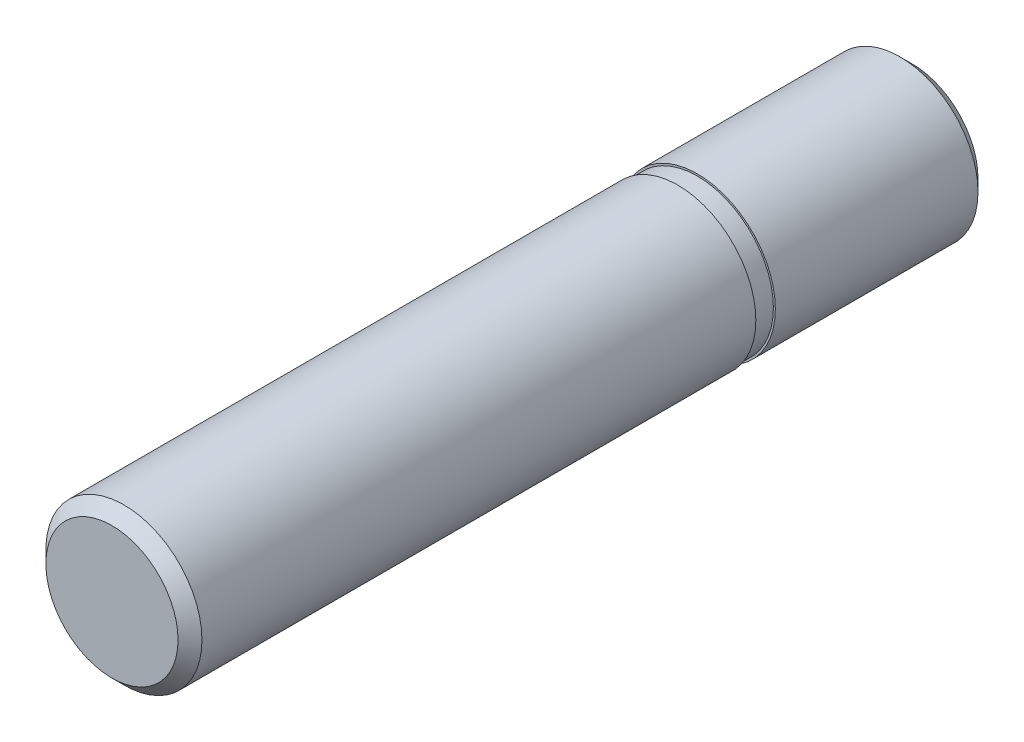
ISO-10303-21;
HEADER;
FILE_DESCRIPTION(('STEP AP214'),'2;1');
FILE_NAME('part.step','',(''),(''),'','','');
FILE_SCHEMA(('AUTOMOTIVE_DESIGN { 1 0 10303 214 1 1 1 1 }'));
ENDSEC;
DATA;
#1=APPLICATION_CONTEXT('core data for automotive mechanical design processes');
#2=APPLICATION_PROTOCOL_DEFINITION('international standard','automotive_design',2000,#1);
#3=PRODUCT_CONTEXT('',#1,'mechanical');
#4=PRODUCT('Part','Part','',(#3));
#5=PRODUCT_RELATED_PRODUCT_CATEGORY('part','',(#4));
#6=PRODUCT_DEFINITION_FORMATION('','',#4);
#7=PRODUCT_DEFINITION_CONTEXT('part definition',#1,'design');
#8=PRODUCT_DEFINITION('design','',#6,#7);
#9=PRODUCT_DEFINITION_SHAPE('','',#8);
#10=(LENGTH_UNIT() NAMED_UNIT(*) SI_UNIT(.MILLI.,.METRE.));
#11=(NAMED_UNIT(*) PLANE_ANGLE_UNIT() SI_UNIT($,.RADIAN.));
#12=(NAMED_UNIT(*) SI_UNIT($,.STERADIAN.) SOLID_ANGLE_UNIT());
#13=UNCERTAINTY_MEASURE_WITH_UNIT(LENGTH_MEASURE(1.E-05),#10,'distance_accuracy_value','');
#14=(GEOMETRIC_REPRESENTATION_CONTEXT(3) GLOBAL_UNCERTAINTY_ASSIGNED_CONTEXT((#13)) GLOBAL_UNIT_ASSIGNED_CONTEXT((#10,
#11,#12)) REPRESENTATION_CONTEXT('',''));
#15=CARTESIAN_POINT('',(0.,0.,0.));
#16=DIRECTION('',(0.,0.,1.));
#17=DIRECTION('',(1.,0.,0.));
#18=AXIS2_PLACEMENT_3D('',#15,#16,#17);
#19=CARTESIAN_POINT('',(0.,3.3865,-22.));
#20=DIRECTION('',(0.,0.,-1.));
#21=DIRECTION('',(-1.,0.,0.));
#22=AXIS2_PLACEMENT_3D('',#19,#20,#21);
#23=PLANE('',#22);
#24=CARTESIAN_POINT('',(0.,0.,-22.));
#25=DIRECTION('',(0.,0.,1.));
#26=DIRECTION('',(1.,0.,0.));
#27=AXIS2_PLACEMENT_3D('',#24,#25,#26);
#28=CIRCLE('',#27,6.773);
#29=CARTESIAN_POINT('',(6.773,0.,-22.));
#30=VERTEX_POINT('',#29);
#31=EDGE_CURVE('E19',#30,#30,#28,.T.);
#32=ORIENTED_EDGE('',*,*,#31,.F.);
#33=EDGE_LOOP('',(#32));
#34=FACE_BOUND('',#33,.T.);
#35=ADVANCED_FACE('F12',(#34),#23,.T.);
#36=CARTESIAN_POINT('',(0.,0.,-20.773));
#37=DIRECTION('',(0.,0.,1.));
#38=DIRECTION('',(1.,0.,0.));
#39=AXIS2_PLACEMENT_3D('',#36,#37,#38);
#40=CONICAL_SURFACE('',#39,8.,0.785398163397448);
#41=CARTESIAN_POINT('',(0.,0.,-20.773));
#42=DIRECTION('',(0.,0.,1.));
#43=DIRECTION('',(1.,0.,0.));
#44=AXIS2_PLACEMENT_3D('',#41,#42,#43);
#45=CIRCLE('',#44,8.);
#46=CARTESIAN_POINT('',(8.,0.,-20.773));
#47=VERTEX_POINT('',#46);
#48=EDGE_CURVE('E23',#47,#47,#45,.T.);
#49=ORIENTED_EDGE('',*,*,#48,.F.);
#50=EDGE_LOOP('',(#49));
#51=FACE_BOUND('',#50,.T.);
#52=ORIENTED_EDGE('',*,*,#31,.T.);
#53=EDGE_LOOP('',(#52));
#54=FACE_BOUND('',#53,.T.);
#55=ADVANCED_FACE('F66',(#51,#54),#40,.T.);
#56=CARTESIAN_POINT('',(0.,0.,5.));
#57=DIRECTION('',(0.,0.,1.));
#58=DIRECTION('',(1.,0.,0.));
#59=AXIS2_PLACEMENT_3D('',#56,#57,#58);
#60=CYLINDRICAL_SURFACE('',#59,8.);
#61=CARTESIAN_POINT('',(0.,0.,0.));
#62=DIRECTION('',(0.,0.,1.));
#63=DIRECTION('',(1.,0.,0.));
#64=AXIS2_PLACEMENT_3D('',#61,#62,#63);
#65=CIRCLE('',#64,8.);
#66=CARTESIAN_POINT('',(8.,0.,0.));
#67=VERTEX_POINT('',#66);
#68=EDGE_CURVE('E28',#67,#67,#65,.T.);
#69=ORIENTED_EDGE('',*,*,#68,.F.);
#70=EDGE_LOOP('',(#69));
#71=FACE_BOUND('',#70,.T.);
#72=ORIENTED_EDGE('',*,*,#48,.T.);
#73=EDGE_LOOP('',(#72));
#74=FACE_BOUND('',#73,.T.);
#75=ADVANCED_FACE('F72',(#71,#74),#60,.T.);
#76=CARTESIAN_POINT('',(0.,0.,0.));
#77=DIRECTION('',(0.,0.,1.));
#78=DIRECTION('',(1.,0.,0.));
#79=AXIS2_PLACEMENT_3D('',#76,#77,#78);
#80=PLANE('',#79);
#81=CARTESIAN_POINT('',(0.,0.,0.));
#82=DIRECTION('',(0.,0.,1.));
#83=DIRECTION('',(1.,0.,0.));
#84=AXIS2_PLACEMENT_3D('',#81,#82,#83);
#85=CIRCLE('',#84,7.8);
#86=CARTESIAN_POINT('',(7.8,0.,0.));
#87=VERTEX_POINT('',#86);
#88=EDGE_CURVE('E8',#87,#87,#85,.T.);
#89=ORIENTED_EDGE('',*,*,#88,.F.);
#90=EDGE_LOOP('',(#89));
#91=FACE_BOUND('',#90,.T.);
#92=ORIENTED_EDGE('',*,*,#68,.T.);
#93=EDGE_LOOP('',(#92));
#94=FACE_BOUND('',#93,.T.);
#95=ADVANCED_FACE('F77',(#91,#94),#80,.T.);
#96=CARTESIAN_POINT('',(0.,0.,-4.42465244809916));
#97=DIRECTION('',(0.,0.,-1.));
#98=DIRECTION('',(-1.,0.,0.));
#99=AXIS2_PLACEMENT_3D('',#96,#97,#98);
#100=CYLINDRICAL_SURFACE('',#99,7.8);
#101=CARTESIAN_POINT('',(0.,0.,2.));
#102=DIRECTION('',(0.,0.,-1.));
#103=DIRECTION('',(-1.,0.,0.));
#104=AXIS2_PLACEMENT_3D('',#101,#102,#103);
#105=CIRCLE('',#104,7.8);
#106=CARTESIAN_POINT('',(-7.8,0.,2.));
#107=VERTEX_POINT('',#106);
#108=EDGE_CURVE('E44',#107,#107,#105,.T.);
#109=ORIENTED_EDGE('',*,*,#108,.T.);
#110=EDGE_LOOP('',(#109));
#111=FACE_BOUND('',#110,.T.);
#112=ORIENTED_EDGE('',*,*,#88,.T.);
#113=EDGE_LOOP('',(#112));
#114=FACE_BOUND('',#113,.T.);
#115=ADVANCED_FACE('F51',(#111,#114),#100,.T.);
#116=CARTESIAN_POINT('',(0.,0.,60.));
#117=DIRECTION('',(0.,0.,1.));
#118=DIRECTION('',(1.,0.,0.));
#119=AXIS2_PLACEMENT_3D('',#116,#117,#118);
#120=PLANE('',#119);
#121=CARTESIAN_POINT('',(0.,0.,60.));
#122=DIRECTION('',(0.,0.,1.));
#123=DIRECTION('',(1.,0.,0.));
#124=AXIS2_PLACEMENT_3D('',#121,#122,#123);
#125=CIRCLE('',#124,6.773);
#126=CARTESIAN_POINT('',(6.773,0.,60.));
#127=VERTEX_POINT('',#126);
#128=EDGE_CURVE('E40',#127,#127,#125,.T.);
#129=ORIENTED_EDGE('',*,*,#128,.T.);
#130=EDGE_LOOP('',(#129));
#131=FACE_BOUND('',#130,.T.);
#132=ADVANCED_FACE('F85',(#131),#120,.T.);
#133=CARTESIAN_POINT('',(0.,0.,60.));
#134=DIRECTION('',(0.,0.,-1.));
#135=DIRECTION('',(-1.,0.,0.));
#136=AXIS2_PLACEMENT_3D('',#133,#134,#135);
#137=CONICAL_SURFACE('',#136,6.773,0.785398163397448);
#138=CARTESIAN_POINT('',(0.,0.,58.773));
#139=DIRECTION('',(0.,0.,1.));
#140=DIRECTION('',(1.,0.,0.));
#141=AXIS2_PLACEMENT_3D('',#138,#139,#140);
#142=CIRCLE('',#141,8.);
#143=CARTESIAN_POINT('',(8.,0.,58.773));
#144=VERTEX_POINT('',#143);
#145=EDGE_CURVE('E31',#144,#144,#142,.F.);
#146=ORIENTED_EDGE('',*,*,#145,.F.);
#147=EDGE_LOOP('',(#146));
#148=FACE_BOUND('',#147,.T.);
#149=ORIENTED_EDGE('',*,*,#128,.F.);
#150=EDGE_LOOP('',(#149));
#151=FACE_BOUND('',#150,.T.);
#152=ADVANCED_FACE('F62',(#148,#151),#137,.T.);
#153=CARTESIAN_POINT('',(0.,0.,5.));
#154=DIRECTION('',(0.,0.,1.));
#155=DIRECTION('',(1.,0.,0.));
#156=AXIS2_PLACEMENT_3D('',#153,#154,#155);
#157=CYLINDRICAL_SURFACE('',#156,8.);
#158=CARTESIAN_POINT('',(0.,0.,2.));
#159=DIRECTION('',(0.,0.,1.));
#160=DIRECTION('',(1.,0.,0.));
#161=AXIS2_PLACEMENT_3D('',#158,#159,#160);
#162=CIRCLE('',#161,8.);
#163=CARTESIAN_POINT('',(8.,0.,2.));
#164=VERTEX_POINT('',#163);
#165=EDGE_CURVE('E35',#164,#164,#162,.T.);
#166=ORIENTED_EDGE('',*,*,#165,.T.);
#167=EDGE_LOOP('',(#166));
#168=FACE_BOUND('',#167,.T.);
#169=ORIENTED_EDGE('',*,*,#145,.T.);
#170=EDGE_LOOP('',(#169));
#171=FACE_BOUND('',#170,.T.);
#172=ADVANCED_FACE('F14',(#168,#171),#157,.T.);
#173=CARTESIAN_POINT('',(0.,0.,2.));
#174=DIRECTION('',(0.,0.,1.));
#175=DIRECTION('',(1.,0.,0.));
#176=AXIS2_PLACEMENT_3D('',#173,#174,#175);
#177=PLANE('',#176);
#178=ORIENTED_EDGE('',*,*,#108,.F.);
#179=EDGE_LOOP('',(#178));
#180=FACE_BOUND('',#179,.T.);
#181=ORIENTED_EDGE('',*,*,#165,.F.);
#182=EDGE_LOOP('',(#181));
#183=FACE_BOUND('',#182,.T.);
#184=ADVANCED_FACE('F53',(#180,#183),#177,.F.);
#185=CLOSED_SHELL('',(#35,#55,#75,#95,#115,#132,#152,#172,#184));
#186=MANIFOLD_SOLID_BREP('B1',#185);
#187=ADVANCED_BREP_SHAPE_REPRESENTATION('',(#18,#186),#14);
#188=SHAPE_DEFINITION_REPRESENTATION(#9,#187);
ENDSEC;
END-ISO-10303-21;
